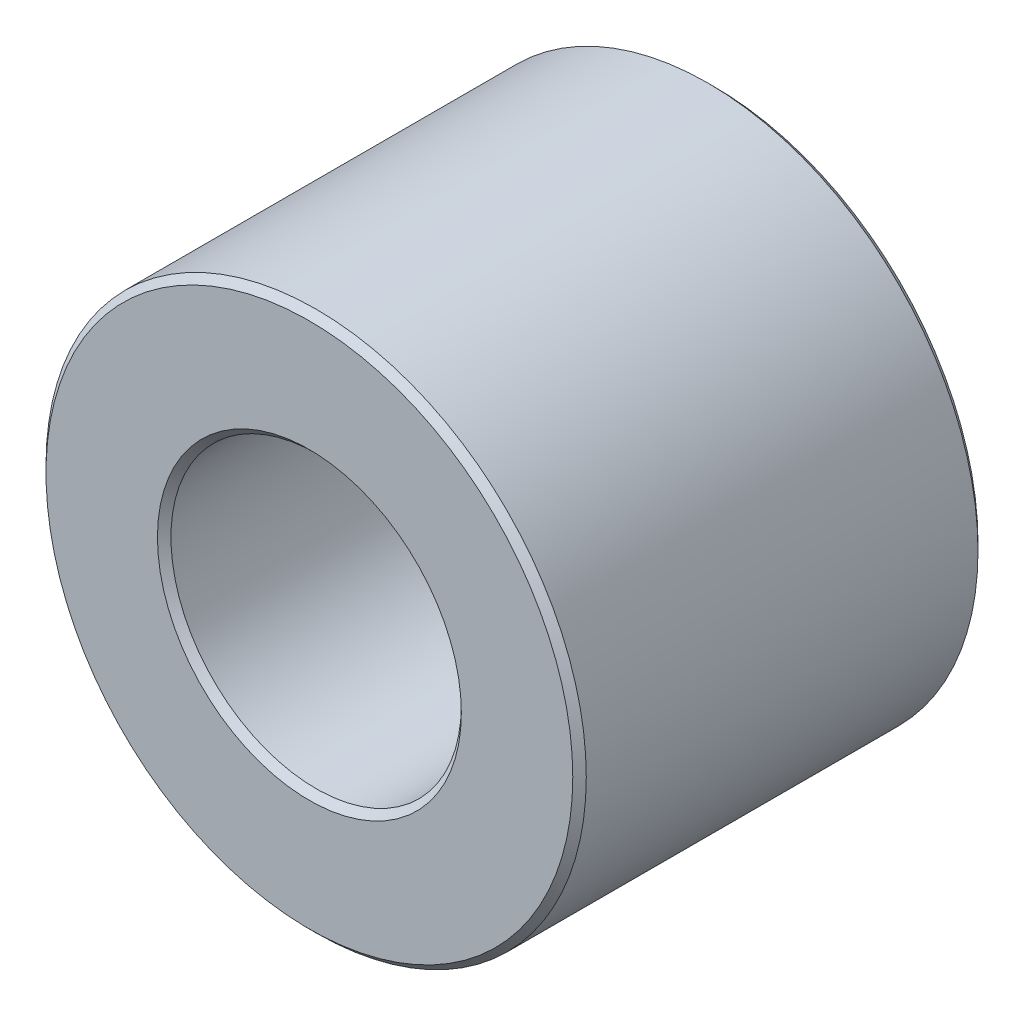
ISO-10303-21;
HEADER;
FILE_DESCRIPTION(('STEP AP214'),'2;1');
FILE_NAME('part.step','',(''),(''),'','','');
FILE_SCHEMA(('AUTOMOTIVE_DESIGN { 1 0 10303 214 1 1 1 1 }'));
ENDSEC;
DATA;
#1=APPLICATION_CONTEXT('core data for automotive mechanical design processes');
#2=APPLICATION_PROTOCOL_DEFINITION('international standard','automotive_design',2000,#1);
#3=PRODUCT_CONTEXT('',#1,'mechanical');
#4=PRODUCT('Part','Part','',(#3));
#5=PRODUCT_RELATED_PRODUCT_CATEGORY('part','',(#4));
#6=PRODUCT_DEFINITION_FORMATION('','',#4);
#7=PRODUCT_DEFINITION_CONTEXT('part definition',#1,'design');
#8=PRODUCT_DEFINITION('design','',#6,#7);
#9=PRODUCT_DEFINITION_SHAPE('','',#8);
#10=(LENGTH_UNIT() NAMED_UNIT(*) SI_UNIT(.MILLI.,.METRE.));
#11=(NAMED_UNIT(*) PLANE_ANGLE_UNIT() SI_UNIT($,.RADIAN.));
#12=(NAMED_UNIT(*) SI_UNIT($,.STERADIAN.) SOLID_ANGLE_UNIT());
#13=UNCERTAINTY_MEASURE_WITH_UNIT(LENGTH_MEASURE(1.E-05),#10,'distance_accuracy_value','');
#14=(GEOMETRIC_REPRESENTATION_CONTEXT(3) GLOBAL_UNCERTAINTY_ASSIGNED_CONTEXT((#13)) GLOBAL_UNIT_ASSIGNED_CONTEXT((#10,
#11,#12)) REPRESENTATION_CONTEXT('',''));
#15=CARTESIAN_POINT('',(0.,0.,0.));
#16=DIRECTION('',(0.,0.,1.));
#17=DIRECTION('',(1.,0.,0.));
#18=AXIS2_PLACEMENT_3D('',#15,#16,#17);
#19=CARTESIAN_POINT('',(0.,0.,3.));
#20=DIRECTION('',(0.,0.,1.));
#21=DIRECTION('',(1.,0.,0.));
#22=AXIS2_PLACEMENT_3D('',#19,#20,#21);
#23=PLANE('',#22);
#24=CARTESIAN_POINT('',(0.,0.,3.));
#25=DIRECTION('',(0.,0.,1.));
#26=DIRECTION('',(1.,0.,0.));
#27=AXIS2_PLACEMENT_3D('',#24,#25,#26);
#28=CIRCLE('',#27,2.25);
#29=CARTESIAN_POINT('',(2.25,0.,3.));
#30=VERTEX_POINT('',#29);
#31=EDGE_CURVE('E10',#30,#30,#28,.F.);
#32=ORIENTED_EDGE('',*,*,#31,.T.);
#33=EDGE_LOOP('',(#32));
#34=FACE_BOUND('',#33,.T.);
#35=CARTESIAN_POINT('',(0.,0.,3.));
#36=DIRECTION('',(0.,0.,1.));
#37=DIRECTION('',(1.,0.,0.));
#38=AXIS2_PLACEMENT_3D('',#35,#36,#37);
#39=CIRCLE('',#38,3.9);
#40=CARTESIAN_POINT('',(3.9,0.,3.));
#41=VERTEX_POINT('',#40);
#42=EDGE_CURVE('E45',#41,#41,#39,.T.);
#43=ORIENTED_EDGE('',*,*,#42,.T.);
#44=EDGE_LOOP('',(#43));
#45=FACE_BOUND('',#44,.T.);
#46=ADVANCED_FACE('F37',(#34,#45),#23,.T.);
#47=CARTESIAN_POINT('',(0.,0.,-3.));
#48=DIRECTION('',(0.,0.,1.));
#49=DIRECTION('',(1.,0.,0.));
#50=AXIS2_PLACEMENT_3D('',#47,#48,#49);
#51=PLANE('',#50);
#52=CARTESIAN_POINT('',(0.,0.,-3.));
#53=DIRECTION('',(0.,0.,1.));
#54=DIRECTION('',(1.,0.,0.));
#55=AXIS2_PLACEMENT_3D('',#52,#53,#54);
#56=CIRCLE('',#55,3.9);
#57=CARTESIAN_POINT('',(3.9,0.,-3.));
#58=VERTEX_POINT('',#57);
#59=EDGE_CURVE('E63',#58,#58,#56,.F.);
#60=ORIENTED_EDGE('',*,*,#59,.T.);
#61=EDGE_LOOP('',(#60));
#62=FACE_BOUND('',#61,.T.);
#63=CARTESIAN_POINT('',(0.,0.,-3.));
#64=DIRECTION('',(0.,0.,1.));
#65=DIRECTION('',(1.,0.,0.));
#66=AXIS2_PLACEMENT_3D('',#63,#64,#65);
#67=CIRCLE('',#66,2.25);
#68=CARTESIAN_POINT('',(2.25,0.,-3.));
#69=VERTEX_POINT('',#68);
#70=EDGE_CURVE('E66',#69,#69,#67,.T.);
#71=ORIENTED_EDGE('',*,*,#70,.T.);
#72=EDGE_LOOP('',(#71));
#73=FACE_BOUND('',#72,.T.);
#74=ADVANCED_FACE('F89',(#62,#73),#51,.F.);
#75=CARTESIAN_POINT('',(0.,0.,3.));
#76=DIRECTION('',(0.,0.,-1.));
#77=DIRECTION('',(-1.,0.,0.));
#78=AXIS2_PLACEMENT_3D('',#75,#76,#77);
#79=CYLINDRICAL_SURFACE('',#78,4.);
#80=CARTESIAN_POINT('',(0.,0.,-2.9));
#81=DIRECTION('',(0.,0.,1.));
#82=DIRECTION('',(1.,0.,0.));
#83=AXIS2_PLACEMENT_3D('',#80,#81,#82);
#84=CIRCLE('',#83,4.);
#85=CARTESIAN_POINT('',(4.,0.,-2.9));
#86=VERTEX_POINT('',#85);
#87=EDGE_CURVE('E70',#86,#86,#84,.T.);
#88=ORIENTED_EDGE('',*,*,#87,.T.);
#89=EDGE_LOOP('',(#88));
#90=FACE_BOUND('',#89,.T.);
#91=CARTESIAN_POINT('',(0.,0.,2.9));
#92=DIRECTION('',(0.,0.,1.));
#93=DIRECTION('',(1.,0.,0.));
#94=AXIS2_PLACEMENT_3D('',#91,#92,#93);
#95=CIRCLE('',#94,4.);
#96=CARTESIAN_POINT('',(4.,0.,2.9));
#97=VERTEX_POINT('',#96);
#98=EDGE_CURVE('E73',#97,#97,#95,.F.);
#99=ORIENTED_EDGE('',*,*,#98,.T.);
#100=EDGE_LOOP('',(#99));
#101=FACE_BOUND('',#100,.T.);
#102=ADVANCED_FACE('F78',(#90,#101),#79,.T.);
#103=CARTESIAN_POINT('',(0.,0.,3.));
#104=DIRECTION('',(0.,0.,-1.));
#105=DIRECTION('',(-1.,0.,0.));
#106=AXIS2_PLACEMENT_3D('',#103,#104,#105);
#107=CYLINDRICAL_SURFACE('',#106,2.15);
#108=CARTESIAN_POINT('',(0.,0.,-2.9));
#109=DIRECTION('',(0.,0.,1.));
#110=DIRECTION('',(1.,0.,0.));
#111=AXIS2_PLACEMENT_3D('',#108,#109,#110);
#112=CIRCLE('',#111,2.15);
#113=CARTESIAN_POINT('',(2.15,0.,-2.9));
#114=VERTEX_POINT('',#113);
#115=EDGE_CURVE('E51',#114,#114,#112,.F.);
#116=ORIENTED_EDGE('',*,*,#115,.T.);
#117=EDGE_LOOP('',(#116));
#118=FACE_BOUND('',#117,.T.);
#119=CARTESIAN_POINT('',(0.,0.,2.9));
#120=DIRECTION('',(0.,0.,1.));
#121=DIRECTION('',(1.,0.,0.));
#122=AXIS2_PLACEMENT_3D('',#119,#120,#121);
#123=CIRCLE('',#122,2.15);
#124=CARTESIAN_POINT('',(2.15,0.,2.9));
#125=VERTEX_POINT('',#124);
#126=EDGE_CURVE('E57',#125,#125,#123,.T.);
#127=ORIENTED_EDGE('',*,*,#126,.T.);
#128=EDGE_LOOP('',(#127));
#129=FACE_BOUND('',#128,.T.);
#130=ADVANCED_FACE('F97',(#118,#129),#107,.F.);
#131=CARTESIAN_POINT('',(0.,0.,-2.9));
#132=DIRECTION('',(0.,0.,1.));
#133=DIRECTION('',(1.,0.,0.));
#134=AXIS2_PLACEMENT_3D('',#131,#132,#133);
#135=CONICAL_SURFACE('',#134,4.,0.785398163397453);
#136=CARTESIAN_POINT('',(3.9,0.,-3.));
#137=CARTESIAN_POINT('',(3.90104166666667,0.,-2.99895833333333));
#138=CARTESIAN_POINT('',(3.90208333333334,0.,-2.99791666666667));
#139=CARTESIAN_POINT('',(3.90416666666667,0.,-2.99583333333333));
#140=CARTESIAN_POINT('',(3.90520833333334,0.,-2.99479166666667));
#141=CARTESIAN_POINT('',(3.90729166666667,0.,-2.99270833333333));
#142=CARTESIAN_POINT('',(3.90833333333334,0.,-2.99166666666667));
#143=CARTESIAN_POINT('',(3.91041666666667,0.,-2.98958333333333));
#144=CARTESIAN_POINT('',(3.91145833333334,0.,-2.98854166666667));
#145=CARTESIAN_POINT('',(3.91354166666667,0.,-2.98645833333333));
#146=CARTESIAN_POINT('',(3.91458333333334,0.,-2.98541666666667));
#147=CARTESIAN_POINT('',(3.91666666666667,0.,-2.98333333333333));
#148=CARTESIAN_POINT('',(3.91770833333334,0.,-2.98229166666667));
#149=CARTESIAN_POINT('',(3.91979166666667,0.,-2.98020833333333));
#150=CARTESIAN_POINT('',(3.92083333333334,0.,-2.97916666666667));
#151=CARTESIAN_POINT('',(3.92291666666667,0.,-2.97708333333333));
#152=CARTESIAN_POINT('',(3.92395833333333,0.,-2.97604166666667));
#153=CARTESIAN_POINT('',(3.92604166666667,0.,-2.97395833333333));
#154=CARTESIAN_POINT('',(3.92708333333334,0.,-2.97291666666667));
#155=CARTESIAN_POINT('',(3.92916666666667,0.,-2.97083333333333));
#156=CARTESIAN_POINT('',(3.93020833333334,0.,-2.96979166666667));
#157=CARTESIAN_POINT('',(3.93229166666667,0.,-2.96770833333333));
#158=CARTESIAN_POINT('',(3.93333333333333,0.,-2.96666666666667));
#159=CARTESIAN_POINT('',(3.93541666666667,0.,-2.96458333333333));
#160=CARTESIAN_POINT('',(3.93645833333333,0.,-2.96354166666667));
#161=CARTESIAN_POINT('',(3.93854166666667,0.,-2.96145833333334));
#162=CARTESIAN_POINT('',(3.93958333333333,0.,-2.96041666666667));
#163=CARTESIAN_POINT('',(3.94166666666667,0.,-2.95833333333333));
#164=CARTESIAN_POINT('',(3.94270833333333,0.,-2.95729166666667));
#165=CARTESIAN_POINT('',(3.94479166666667,0.,-2.95520833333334));
#166=CARTESIAN_POINT('',(3.94583333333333,0.,-2.95416666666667));
#167=CARTESIAN_POINT('',(3.94791666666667,0.,-2.95208333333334));
#168=CARTESIAN_POINT('',(3.94895833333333,0.,-2.95104166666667));
#169=CARTESIAN_POINT('',(3.95104166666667,0.,-2.94895833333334));
#170=CARTESIAN_POINT('',(3.95208333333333,0.,-2.94791666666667));
#171=CARTESIAN_POINT('',(3.95416666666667,0.,-2.94583333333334));
#172=CARTESIAN_POINT('',(3.95520833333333,0.,-2.94479166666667));
#173=CARTESIAN_POINT('',(3.95729166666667,0.,-2.94270833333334));
#174=CARTESIAN_POINT('',(3.95833333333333,0.,-2.94166666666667));
#175=CARTESIAN_POINT('',(3.96041666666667,0.,-2.93958333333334));
#176=CARTESIAN_POINT('',(3.96145833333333,0.,-2.93854166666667));
#177=CARTESIAN_POINT('',(3.96354166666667,0.,-2.93645833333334));
#178=CARTESIAN_POINT('',(3.96458333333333,0.,-2.93541666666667));
#179=CARTESIAN_POINT('',(3.96666666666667,0.,-2.93333333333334));
#180=CARTESIAN_POINT('',(3.96770833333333,0.,-2.93229166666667));
#181=CARTESIAN_POINT('',(3.96979166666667,0.,-2.93020833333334));
#182=CARTESIAN_POINT('',(3.97083333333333,0.,-2.92916666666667));
#183=CARTESIAN_POINT('',(3.97291666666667,0.,-2.92708333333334));
#184=CARTESIAN_POINT('',(3.97395833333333,0.,-2.92604166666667));
#185=CARTESIAN_POINT('',(3.97604166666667,0.,-2.92395833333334));
#186=CARTESIAN_POINT('',(3.97708333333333,0.,-2.92291666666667));
#187=CARTESIAN_POINT('',(3.97916666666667,0.,-2.92083333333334));
#188=CARTESIAN_POINT('',(3.98020833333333,0.,-2.91979166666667));
#189=CARTESIAN_POINT('',(3.98229166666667,0.,-2.91770833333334));
#190=CARTESIAN_POINT('',(3.98333333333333,0.,-2.91666666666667));
#191=CARTESIAN_POINT('',(3.98541666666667,0.,-2.91458333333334));
#192=CARTESIAN_POINT('',(3.98645833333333,0.,-2.91354166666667));
#193=CARTESIAN_POINT('',(3.98854166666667,0.,-2.91145833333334));
#194=CARTESIAN_POINT('',(3.98958333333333,0.,-2.91041666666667));
#195=CARTESIAN_POINT('',(3.99166666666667,0.,-2.90833333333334));
#196=CARTESIAN_POINT('',(3.99270833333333,0.,-2.90729166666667));
#197=CARTESIAN_POINT('',(3.99479166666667,0.,-2.90520833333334));
#198=CARTESIAN_POINT('',(3.99583333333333,0.,-2.90416666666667));
#199=CARTESIAN_POINT('',(3.99791666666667,0.,-2.90208333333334));
#200=CARTESIAN_POINT('',(3.99895833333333,0.,-2.90104166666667));
#201=CARTESIAN_POINT('',(4.,0.,-2.9));
#202=B_SPLINE_CURVE_WITH_KNOTS('',3,(#136,#137,#138,#139,#140,#141,#142,#143,#144,#145,#146,
#147,#148,#149,#150,#151,#152,#153,#154,#155,#156,#157,#158,#159,#160,#161,#162,#163,#164,#165,
#166,#167,#168,#169,#170,#171,#172,#173,#174,#175,#176,#177,#178,#179,#180,#181,#182,#183,#184,
#185,#186,#187,#188,#189,#190,#191,#192,#193,#194,#195,#196,#197,#198,#199,#200,#201),
.UNSPECIFIED.,.F.,.F.,(4,2,2,2,2,2,2,2,2,2,2,2,2,2,2,2,2,2,2,2,2,2,2,2,2,2,2,2,2,2,2,2,4),(0.,
0.00441941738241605,0.00883883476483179,0.0132582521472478,0.0176776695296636,0.022097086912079,
0.0265165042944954,0.0309359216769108,0.0353553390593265,0.0397747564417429,0.0441941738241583,
0.0486135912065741,0.0530330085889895,0.0574524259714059,0.0618718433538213,0.066291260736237,
0.0707106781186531,0.0751300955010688,0.0795495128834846,0.0839689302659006,0.0883883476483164,
0.0928077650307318,0.0972271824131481,0.101646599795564,0.106066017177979,0.110485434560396,
0.114904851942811,0.119324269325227,0.123743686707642,0.128163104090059,0.132582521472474,
0.13700193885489,0.141421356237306),.UNSPECIFIED.);
#203=EDGE_CURVE('BSEAM102',#58,#86,#202,.T.);
#204=ORIENTED_EDGE('',*,*,#59,.F.);
#205=ORIENTED_EDGE('',*,*,#87,.F.);
#206=ORIENTED_EDGE('',*,*,#203,.T.);
#207=ORIENTED_EDGE('',*,*,#203,.F.);
#208=EDGE_LOOP('',(#204,#206,#205,#207));
#209=FACE_BOUND('',#208,.T.);
#210=ADVANCED_FACE('F102',(#209),#135,.T.);
#211=CARTESIAN_POINT('',(0.,0.,-3.));
#212=DIRECTION('',(0.,0.,-1.));
#213=DIRECTION('',(-1.,0.,0.));
#214=AXIS2_PLACEMENT_3D('',#211,#212,#213);
#215=CONICAL_SURFACE('',#214,2.25,0.785398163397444);
#216=ORIENTED_EDGE('',*,*,#115,.F.);
#217=EDGE_LOOP('',(#216));
#218=FACE_BOUND('',#217,.T.);
#219=ORIENTED_EDGE('',*,*,#70,.F.);
#220=EDGE_LOOP('',(#219));
#221=FACE_BOUND('',#220,.T.);
#222=ADVANCED_FACE('F86',(#218,#221),#215,.F.);
#223=CARTESIAN_POINT('',(0.,0.,2.9));
#224=DIRECTION('',(0.,0.,1.));
#225=DIRECTION('',(1.,0.,0.));
#226=AXIS2_PLACEMENT_3D('',#223,#224,#225);
#227=CONICAL_SURFACE('',#226,2.15,0.78539816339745);
#228=ORIENTED_EDGE('',*,*,#31,.F.);
#229=EDGE_LOOP('',(#228));
#230=FACE_BOUND('',#229,.T.);
#231=ORIENTED_EDGE('',*,*,#126,.F.);
#232=EDGE_LOOP('',(#231));
#233=FACE_BOUND('',#232,.T.);
#234=ADVANCED_FACE('F82',(#230,#233),#227,.F.);
#235=CARTESIAN_POINT('',(0.,0.,3.));
#236=DIRECTION('',(0.,0.,-1.));
#237=DIRECTION('',(-1.,0.,0.));
#238=AXIS2_PLACEMENT_3D('',#235,#236,#237);
#239=CONICAL_SURFACE('',#238,3.9,0.785398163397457);
#240=ORIENTED_EDGE('',*,*,#98,.F.);
#241=EDGE_LOOP('',(#240));
#242=FACE_BOUND('',#241,.T.);
#243=ORIENTED_EDGE('',*,*,#42,.F.);
#244=EDGE_LOOP('',(#243));
#245=FACE_BOUND('',#244,.T.);
#246=ADVANCED_FACE('F39',(#242,#245),#239,.T.);
#247=CLOSED_SHELL('',(#46,#74,#102,#130,#210,#222,#234,#246));
#248=MANIFOLD_SOLID_BREP('B2',#247);
#249=ADVANCED_BREP_SHAPE_REPRESENTATION('',(#18,#248),#14);
#250=SHAPE_DEFINITION_REPRESENTATION(#9,#249);
ENDSEC;
END-ISO-10303-21;
